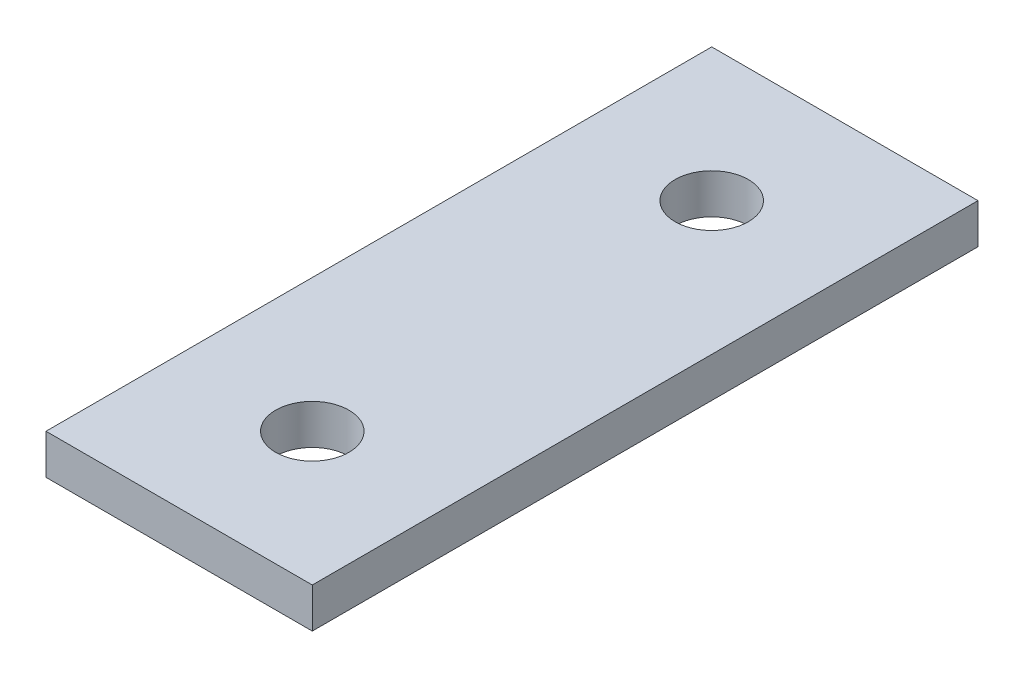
from build123d import *

# Parameters (mm, degrees)
SKETCH1_W      = 20
SKETCH1_H      = 50
SKETCH1_R      = 2.75
EXTRUDE1_DEPTH = 3


with BuildPart() as part:
    # Sketch1 → Extrude1 (new body)
    with BuildSketch(Plane(origin=(0, 0, 0), x_dir=(1, 0, 0), z_dir=(0, 1, 0))):
        with Locations((10, 25)):
            Rectangle(SKETCH1_W, SKETCH1_H)
        with Locations(Location((10, 40, 0), (0, 0, 270))):
            Circle(SKETCH1_R, mode=Mode.SUBTRACT)
        with Locations(Location((10, 10, 0), (0, 0, 270))):
            Circle(SKETCH1_R, mode=Mode.SUBTRACT)
    extrude(amount=EXTRUDE1_DEPTH)


solid = part.part
